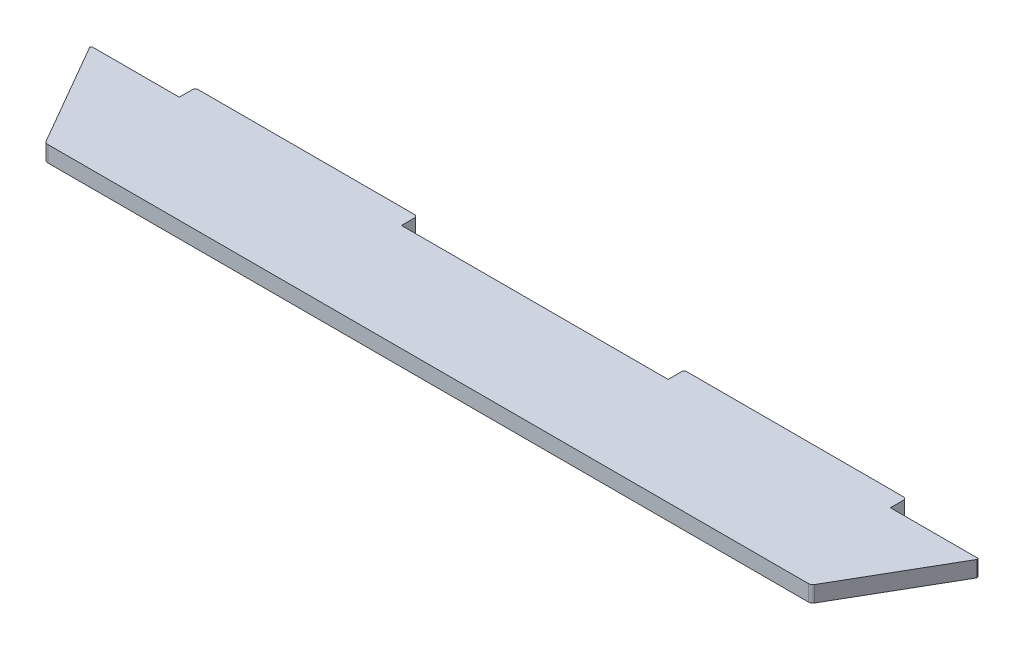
from build123d import *
from OCP.BRepFilletAPI import BRepFilletAPI_MakeChamfer

# Parameters (mm, degrees)
SALIENTE_EXTRUIR1_DEPTH = 18
CROQUIS2_W              = 1000
CROQUIS2_H              = 433.012701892
CORTAR_EXTRUIR1_DEPTH   = 662.682703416
CROQUIS3_W              = 250
CROQUIS3_H              = 18
SALIENTE_EXTRUIR2_DEPTH = 18
CROQUIS4_W              = 1000
CROQUIS4_H              = 313.012701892
CORTAR_EXTRUIR2_DEPTH   = 662.682703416
REDONDEO1_R             = 5
CHAFL_N1_SIZE           = 2
CHAFL_N1_SIZE2          = 1.464101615


with BuildPart() as part:
    # Croquis1 → Saliente-Extruir1 (new body)
    with BuildSketch(Plane(origin=(0, 0, 0), x_dir=(1, 0, 0), z_dir=(0, 1, 0))):
        Polygon((250, 433.012701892), (-250, 433.012701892), (-500, 0), (-250, -433.012701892), (250, -433.012701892), (500, 0), align=None)
    extrude(amount=SALIENTE_EXTRUIR1_DEPTH)

    # Croquis2 → Cortar-Extruir1 (cut, through all)
    with BuildSketch(Plane(origin=(0, 18, 0), x_dir=(1, 0, 0), z_dir=(0, 1, 0))):
        with Locations((0, 216.506350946)):
            Rectangle(CROQUIS2_W, CROQUIS2_H)
    extrude(amount=-CORTAR_EXTRUIR1_DEPTH, mode=Mode.SUBTRACT)

    # Croquis3 → Saliente-Extruir2 (add, through all)
    with BuildSketch(Plane(origin=(0, 18, 0), x_dir=(1, 0, 0), z_dir=(0, 1, 0))):
        with Locations((-275, 9)):
            Rectangle(CROQUIS3_W, CROQUIS3_H)
        with Locations((275, 9)):
            Rectangle(CROQUIS3_W, CROQUIS3_H)
    extrude(amount=-SALIENTE_EXTRUIR2_DEPTH)

    # Croquis4 → Cortar-Extruir2 (cut, through all)
    with BuildSketch(Plane(origin=(0, 18, 0), x_dir=(1, 0, 0), z_dir=(0, 1, 0))):
        with Locations((0, -276.506350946)):
            Rectangle(CROQUIS4_W, CROQUIS4_H)
    extrude(amount=-CORTAR_EXTRUIR2_DEPTH, mode=Mode.SUBTRACT)

    # Redondeo1
    redondeo1_edges = [part.edges().sort_by_distance(p)[0] for p in [
        (-430.717967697, 9, 120),
        (430.717967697, 9, 120),
    ]]
    fillet(redondeo1_edges, radius=REDONDEO1_R)

    # Chafl_n1: one chamfer whose edges measure the first distance from different faces: ONE call of the kernel's chamfer builder (chamfer() names one face for all edges)
    chafl_n1_edges_1 = [part.edges().sort_by_distance(p)[0] for p in [
        (500, 9, 0),
    ]]
    chafl_n1_side_1 = [part.faces().sort_by_distance(p)[0] for p in [
        (466.080671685, 9, 58.75),
    ]]
    chafl_n1_edges_2 = [part.edges().sort_by_distance(p)[0] for p in [
        (-500, 9, 0),
    ]]
    chafl_n1_side_2 = [part.faces().sort_by_distance(p)[0] for p in [
        (-450, 9, 0),
    ]]
    chafl_n1_edges_3 = [part.edges().sort_by_distance(p)[0] for p in [
        (-400, 9, -18),
        (-150, 9, -18),
        (150, 9, -18),
        (400, 9, -18),
    ]]
    chafl_n1 = BRepFilletAPI_MakeChamfer(part.part.solid().wrapped)
    for e in chafl_n1_edges_1:
        chafl_n1.Add(CHAFL_N1_SIZE, CHAFL_N1_SIZE2, e.wrapped, chafl_n1_side_1[0].wrapped)  # the first distance lies on this face
    for e in chafl_n1_edges_2:
        chafl_n1.Add(CHAFL_N1_SIZE, CHAFL_N1_SIZE2, e.wrapped, chafl_n1_side_2[0].wrapped)  # the first distance lies on this face
    for e in chafl_n1_edges_3:
        chafl_n1.Add(CHAFL_N1_SIZE, e.wrapped)
    add(Compound.cast(chafl_n1.Shape()), mode=Mode.REPLACE)


solid = part.part
